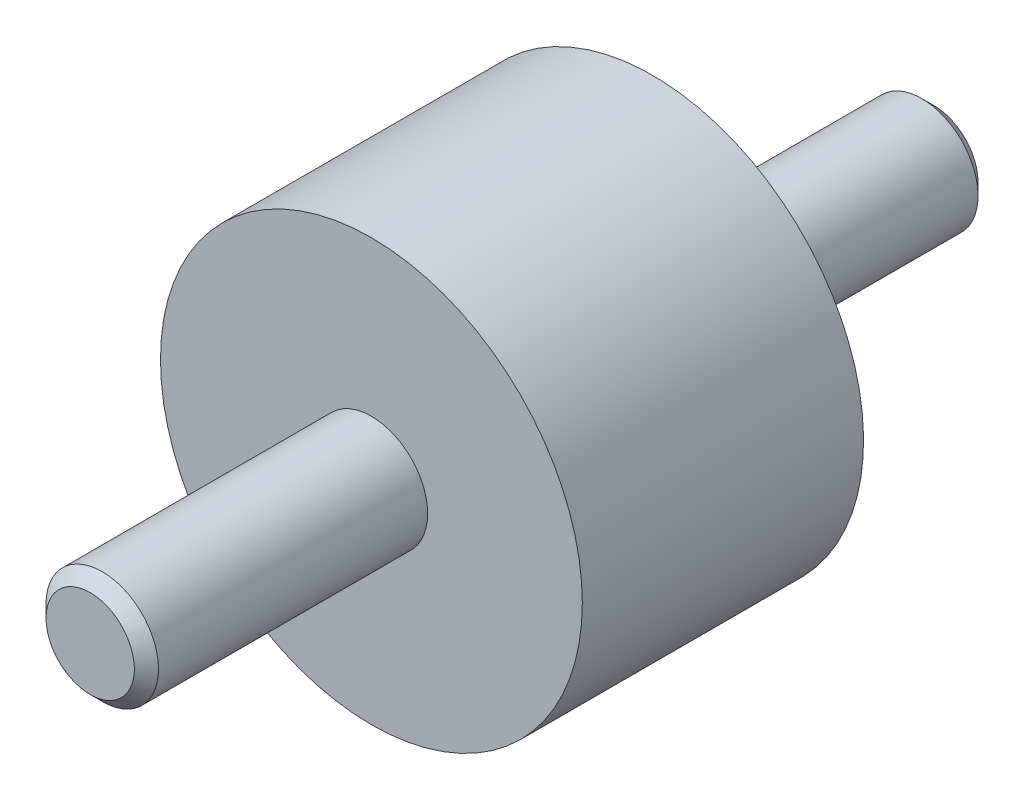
ISO-10303-21;
HEADER;
FILE_DESCRIPTION(('STEP AP214'),'2;1');
FILE_NAME('part.step','',(''),(''),'','','');
FILE_SCHEMA(('AUTOMOTIVE_DESIGN { 1 0 10303 214 1 1 1 1 }'));
ENDSEC;
DATA;
#1=APPLICATION_CONTEXT('core data for automotive mechanical design processes');
#2=APPLICATION_PROTOCOL_DEFINITION('international standard','automotive_design',2000,#1);
#3=PRODUCT_CONTEXT('',#1,'mechanical');
#4=PRODUCT('Part','Part','',(#3));
#5=PRODUCT_RELATED_PRODUCT_CATEGORY('part','',(#4));
#6=PRODUCT_DEFINITION_FORMATION('','',#4);
#7=PRODUCT_DEFINITION_CONTEXT('part definition',#1,'design');
#8=PRODUCT_DEFINITION('design','',#6,#7);
#9=PRODUCT_DEFINITION_SHAPE('','',#8);
#10=(LENGTH_UNIT() NAMED_UNIT(*) SI_UNIT(.MILLI.,.METRE.));
#11=(NAMED_UNIT(*) PLANE_ANGLE_UNIT() SI_UNIT($,.RADIAN.));
#12=(NAMED_UNIT(*) SI_UNIT($,.STERADIAN.) SOLID_ANGLE_UNIT());
#13=UNCERTAINTY_MEASURE_WITH_UNIT(LENGTH_MEASURE(1.E-05),#10,'distance_accuracy_value','');
#14=(GEOMETRIC_REPRESENTATION_CONTEXT(3) GLOBAL_UNCERTAINTY_ASSIGNED_CONTEXT((#13)) GLOBAL_UNIT_ASSIGNED_CONTEXT((#10,
#11,#12)) REPRESENTATION_CONTEXT('',''));
#15=CARTESIAN_POINT('',(0.,0.,0.));
#16=DIRECTION('',(0.,0.,1.));
#17=DIRECTION('',(1.,0.,0.));
#18=AXIS2_PLACEMENT_3D('',#15,#16,#17);
#19=CARTESIAN_POINT('',(0.,0.,0.26666666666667));
#20=DIRECTION('',(0.,0.,1.));
#21=DIRECTION('',(0.,-1.,0.));
#22=AXIS2_PLACEMENT_3D('',#19,#20,#21);
#23=CYLINDRICAL_SURFACE('',#22,7.5);
#24=CARTESIAN_POINT('',(0.,0.,0.));
#25=DIRECTION('',(0.,0.,1.));
#26=DIRECTION('',(0.,-1.,0.));
#27=AXIS2_PLACEMENT_3D('',#24,#25,#26);
#28=CIRCLE('',#27,7.5);
#29=CARTESIAN_POINT('',(0.,-7.5,0.));
#30=VERTEX_POINT('',#29);
#31=EDGE_CURVE('E22',#30,#30,#28,.T.);
#32=ORIENTED_EDGE('',*,*,#31,.T.);
#33=EDGE_LOOP('',(#32));
#34=FACE_BOUND('',#33,.T.);
#35=CARTESIAN_POINT('',(0.,0.,10.));
#36=DIRECTION('',(0.,0.,-1.));
#37=DIRECTION('',(-1.,0.,0.));
#38=AXIS2_PLACEMENT_3D('',#35,#36,#37);
#39=CIRCLE('',#38,7.5);
#40=CARTESIAN_POINT('',(-7.5,0.,10.));
#41=VERTEX_POINT('',#40);
#42=EDGE_CURVE('E40',#41,#41,#39,.T.);
#43=ORIENTED_EDGE('',*,*,#42,.T.);
#44=EDGE_LOOP('',(#43));
#45=FACE_BOUND('',#44,.T.);
#46=ADVANCED_FACE('F12',(#34,#45),#23,.T.);
#47=CARTESIAN_POINT('',(7.5,0.,0.));
#48=DIRECTION('',(0.,0.,-1.));
#49=DIRECTION('',(0.,1.,0.));
#50=AXIS2_PLACEMENT_3D('',#47,#48,#49);
#51=PLANE('',#50);
#52=CARTESIAN_POINT('',(0.,0.,0.));
#53=DIRECTION('',(0.,0.,-1.));
#54=DIRECTION('',(0.,1.,0.));
#55=AXIS2_PLACEMENT_3D('',#52,#53,#54);
#56=CIRCLE('',#55,2.);
#57=CARTESIAN_POINT('',(0.,2.,0.));
#58=VERTEX_POINT('',#57);
#59=EDGE_CURVE('E18',#58,#58,#56,.T.);
#60=ORIENTED_EDGE('',*,*,#59,.F.);
#61=EDGE_LOOP('',(#60));
#62=FACE_BOUND('',#61,.T.);
#63=ORIENTED_EDGE('',*,*,#31,.F.);
#64=EDGE_LOOP('',(#63));
#65=FACE_BOUND('',#64,.T.);
#66=ADVANCED_FACE('F63',(#62,#65),#51,.T.);
#67=CARTESIAN_POINT('',(0.,0.,-10.));
#68=DIRECTION('',(0.,0.,1.));
#69=DIRECTION('',(0.,-1.,0.));
#70=AXIS2_PLACEMENT_3D('',#67,#68,#69);
#71=CYLINDRICAL_SURFACE('',#70,2.);
#72=CARTESIAN_POINT('',(0.,0.,-9.5705));
#73=DIRECTION('',(0.,0.,1.));
#74=DIRECTION('',(0.,-1.,0.));
#75=AXIS2_PLACEMENT_3D('',#72,#73,#74);
#76=CIRCLE('',#75,2.);
#77=CARTESIAN_POINT('',(0.,-2.,-9.5705));
#78=VERTEX_POINT('',#77);
#79=EDGE_CURVE('E26',#78,#78,#76,.T.);
#80=ORIENTED_EDGE('',*,*,#79,.T.);
#81=EDGE_LOOP('',(#80));
#82=FACE_BOUND('',#81,.T.);
#83=ORIENTED_EDGE('',*,*,#59,.T.);
#84=EDGE_LOOP('',(#83));
#85=FACE_BOUND('',#84,.T.);
#86=ADVANCED_FACE('F68',(#82,#85),#71,.T.);
#87=CARTESIAN_POINT('',(0.,0.,-9.5705));
#88=DIRECTION('',(0.,0.,1.));
#89=DIRECTION('',(0.,-1.,0.));
#90=AXIS2_PLACEMENT_3D('',#87,#88,#89);
#91=CONICAL_SURFACE('',#90,2.,0.785398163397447);
#92=CARTESIAN_POINT('',(0.,0.,-10.));
#93=DIRECTION('',(0.,0.,1.));
#94=DIRECTION('',(0.,-1.,0.));
#95=AXIS2_PLACEMENT_3D('',#92,#93,#94);
#96=CIRCLE('',#95,1.5705);
#97=CARTESIAN_POINT('',(0.,-1.5705,-10.));
#98=VERTEX_POINT('',#97);
#99=EDGE_CURVE('E31',#98,#98,#96,.T.);
#100=ORIENTED_EDGE('',*,*,#99,.T.);
#101=EDGE_LOOP('',(#100));
#102=FACE_BOUND('',#101,.T.);
#103=ORIENTED_EDGE('',*,*,#79,.F.);
#104=EDGE_LOOP('',(#103));
#105=FACE_BOUND('',#104,.T.);
#106=ADVANCED_FACE('F58',(#102,#105),#91,.T.);
#107=CARTESIAN_POINT('',(1.5705,0.,-10.));
#108=DIRECTION('',(0.,0.,-1.));
#109=DIRECTION('',(0.,1.,0.));
#110=AXIS2_PLACEMENT_3D('',#107,#108,#109);
#111=PLANE('',#110);
#112=ORIENTED_EDGE('',*,*,#99,.F.);
#113=EDGE_LOOP('',(#112));
#114=FACE_BOUND('',#113,.T.);
#115=ADVANCED_FACE('F48',(#114),#111,.T.);
#116=CARTESIAN_POINT('',(0.,2.,10.));
#117=DIRECTION('',(0.,0.,1.));
#118=DIRECTION('',(1.,0.,0.));
#119=AXIS2_PLACEMENT_3D('',#116,#117,#118);
#120=PLANE('',#119);
#121=CARTESIAN_POINT('',(0.,0.,10.));
#122=DIRECTION('',(0.,0.,1.));
#123=DIRECTION('',(1.,0.,0.));
#124=AXIS2_PLACEMENT_3D('',#121,#122,#123);
#125=CIRCLE('',#124,2.);
#126=CARTESIAN_POINT('',(2.,0.,10.));
#127=VERTEX_POINT('',#126);
#128=EDGE_CURVE('E8',#127,#127,#125,.F.);
#129=ORIENTED_EDGE('',*,*,#128,.T.);
#130=EDGE_LOOP('',(#129));
#131=FACE_BOUND('',#130,.T.);
#132=ORIENTED_EDGE('',*,*,#42,.F.);
#133=EDGE_LOOP('',(#132));
#134=FACE_BOUND('',#133,.T.);
#135=ADVANCED_FACE('F45',(#131,#134),#120,.T.);
#136=CARTESIAN_POINT('',(0.,0.,8.));
#137=DIRECTION('',(0.,0.,1.));
#138=DIRECTION('',(0.,-1.,0.));
#139=AXIS2_PLACEMENT_3D('',#136,#137,#138);
#140=CYLINDRICAL_SURFACE('',#139,2.);
#141=ORIENTED_EDGE('',*,*,#128,.F.);
#142=EDGE_LOOP('',(#141));
#143=FACE_BOUND('',#142,.T.);
#144=CARTESIAN_POINT('',(0.,0.,19.5705));
#145=DIRECTION('',(0.,0.,-1.));
#146=DIRECTION('',(-1.,0.,0.));
#147=AXIS2_PLACEMENT_3D('',#144,#145,#146);
#148=CIRCLE('',#147,2.);
#149=CARTESIAN_POINT('',(-2.,0.,19.5705));
#150=VERTEX_POINT('',#149);
#151=EDGE_CURVE('E37',#150,#150,#148,.T.);
#152=ORIENTED_EDGE('',*,*,#151,.T.);
#153=EDGE_LOOP('',(#152));
#154=FACE_BOUND('',#153,.T.);
#155=ADVANCED_FACE('F47',(#143,#154),#140,.T.);
#156=CARTESIAN_POINT('',(0.,0.,20.));
#157=DIRECTION('',(0.,0.,1.));
#158=DIRECTION('',(1.,0.,0.));
#159=AXIS2_PLACEMENT_3D('',#156,#157,#158);
#160=PLANE('',#159);
#161=CARTESIAN_POINT('',(0.,0.,20.));
#162=DIRECTION('',(0.,0.,-1.));
#163=DIRECTION('',(-1.,0.,0.));
#164=AXIS2_PLACEMENT_3D('',#161,#162,#163);
#165=CIRCLE('',#164,1.5705);
#166=CARTESIAN_POINT('',(-1.5705,0.,20.));
#167=VERTEX_POINT('',#166);
#168=EDGE_CURVE('E34',#167,#167,#165,.T.);
#169=ORIENTED_EDGE('',*,*,#168,.F.);
#170=EDGE_LOOP('',(#169));
#171=FACE_BOUND('',#170,.T.);
#172=ADVANCED_FACE('F55',(#171),#160,.T.);
#173=CARTESIAN_POINT('',(0.,0.,19.5705));
#174=DIRECTION('',(0.,0.,-1.));
#175=DIRECTION('',(-1.,0.,0.));
#176=AXIS2_PLACEMENT_3D('',#173,#174,#175);
#177=CONICAL_SURFACE('',#176,2.,0.785398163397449);
#178=ORIENTED_EDGE('',*,*,#168,.T.);
#179=EDGE_LOOP('',(#178));
#180=FACE_BOUND('',#179,.T.);
#181=ORIENTED_EDGE('',*,*,#151,.F.);
#182=EDGE_LOOP('',(#181));
#183=FACE_BOUND('',#182,.T.);
#184=ADVANCED_FACE('F82',(#180,#183),#177,.T.);
#185=CLOSED_SHELL('',(#46,#66,#86,#106,#115,#135,#155,#172,#184));
#186=MANIFOLD_SOLID_BREP('B1',#185);
#187=ADVANCED_BREP_SHAPE_REPRESENTATION('',(#18,#186),#14);
#188=SHAPE_DEFINITION_REPRESENTATION(#9,#187);
ENDSEC;
END-ISO-10303-21;
